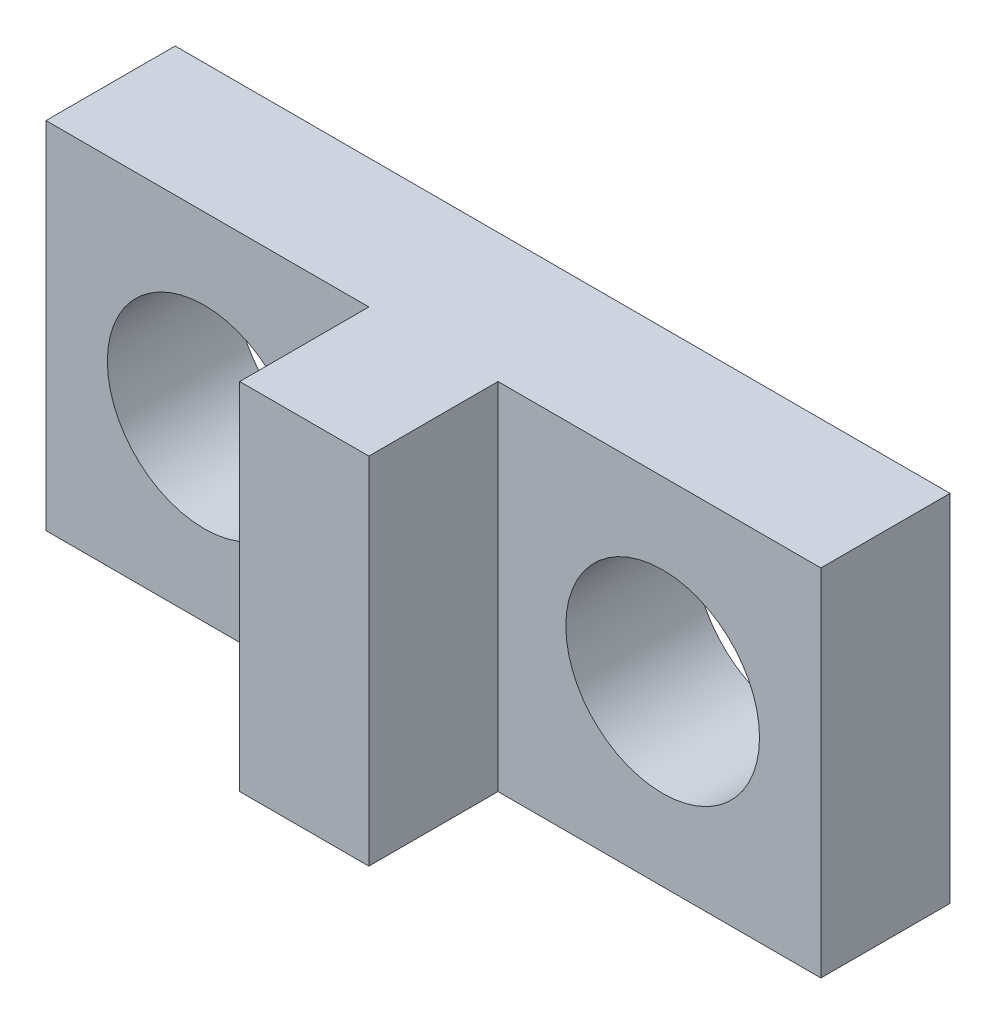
from build123d import *

# Parameters (mm, degrees)
CROQUIS1_W              = 12
CROQUIS1_H              = 5.5
CROQUIS1_R              = 1.5
SALIENTE_EXTRUIR1_DEPTH = 2
CROQUIS2_W              = 2
CROQUIS2_H              = 5.5
SALIENTE_EXTRUIR2_DEPTH = 2


with BuildPart() as part:
    # Croquis1 → Saliente-Extruir1 (new body)
    with BuildSketch(Plane.XY):
        Rectangle(CROQUIS1_W, CROQUIS1_H)
        with Locations((-3.55, 0)):
            Circle(CROQUIS1_R, mode=Mode.SUBTRACT)
        with Locations((3.55, 0)):
            Circle(CROQUIS1_R, mode=Mode.SUBTRACT)
    extrude(amount=SALIENTE_EXTRUIR1_DEPTH)

    # Croquis2 → Saliente-Extruir2 (add)
    with BuildSketch(Plane.XY.offset(2)):
        Rectangle(CROQUIS2_W, CROQUIS2_H)
    extrude(amount=SALIENTE_EXTRUIR2_DEPTH)


solid = part.part
